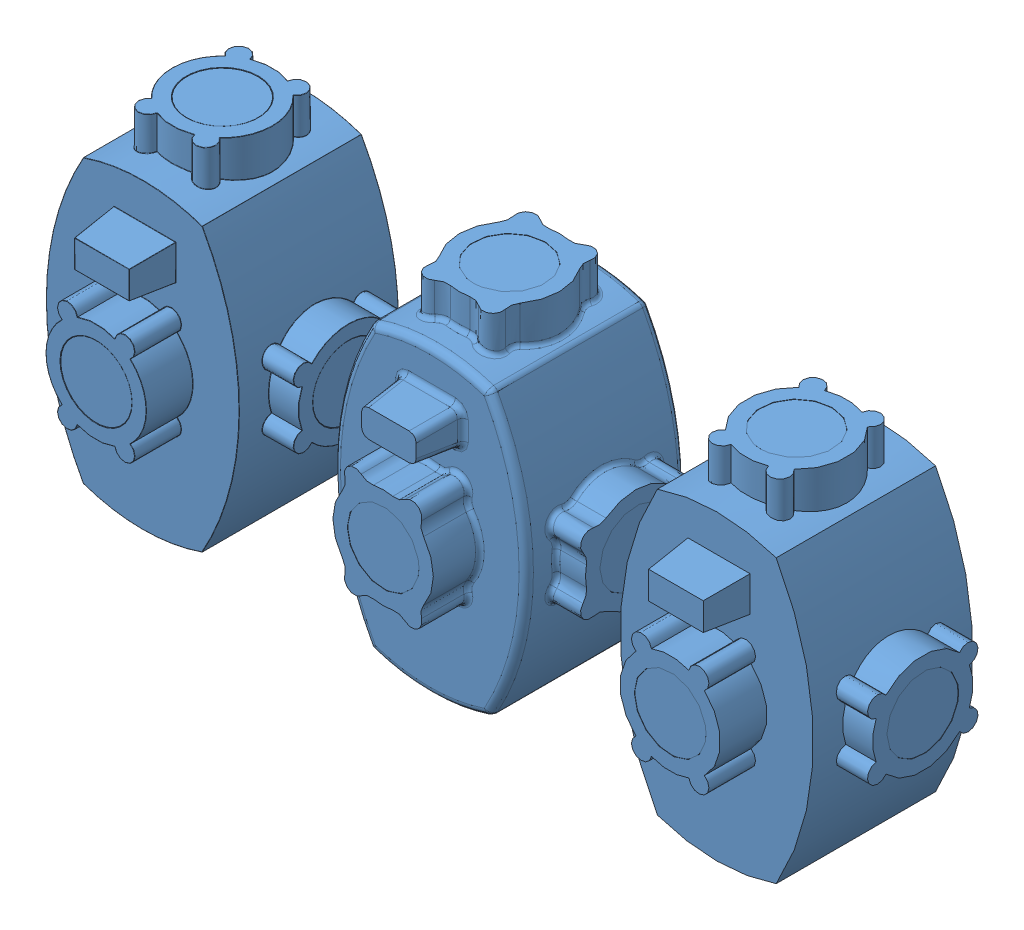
SolidWorks assembly Guss-Assy.SLDASM, configuration Standard (file format 10000). Lengths in mm.
Overall size (555.25 233.4 143.52).
3 component instances, 1 part files, 0 mates.
Components (placement in the parent):
- Guss-gehaeuse-1: Guss-gehaeuse.SLDPRT [vereinfacht] at origin size (155.25 233.38 143.5)
- Guss-gehaeuse-2: Guss-gehaeuse.SLDPRT [fein] at (-200 0 0) size (155.25 233.38 143.5)
- Guss-gehaeuse-3: Guss-gehaeuse.SLDPRT [(mini-Radien)] at (-400 0 0) size (155.27 233.4 143.52)
